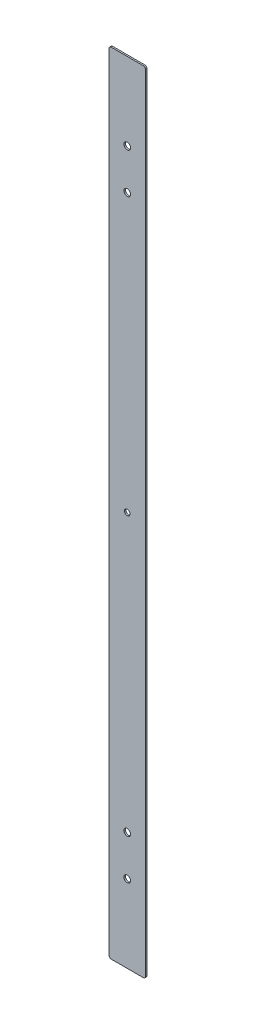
ISO-10303-21;
HEADER;
FILE_DESCRIPTION(('STEP AP214'),'2;1');
FILE_NAME('part.step','',(''),(''),'','','');
FILE_SCHEMA(('AUTOMOTIVE_DESIGN { 1 0 10303 214 1 1 1 1 }'));
ENDSEC;
DATA;
#1=APPLICATION_CONTEXT('core data for automotive mechanical design processes');
#2=APPLICATION_PROTOCOL_DEFINITION('international standard','automotive_design',2000,#1);
#3=PRODUCT_CONTEXT('',#1,'mechanical');
#4=PRODUCT('Part','Part','',(#3));
#5=PRODUCT_RELATED_PRODUCT_CATEGORY('part','',(#4));
#6=PRODUCT_DEFINITION_FORMATION('','',#4);
#7=PRODUCT_DEFINITION_CONTEXT('part definition',#1,'design');
#8=PRODUCT_DEFINITION('design','',#6,#7);
#9=PRODUCT_DEFINITION_SHAPE('','',#8);
#10=(LENGTH_UNIT() NAMED_UNIT(*) SI_UNIT(.MILLI.,.METRE.));
#11=(NAMED_UNIT(*) PLANE_ANGLE_UNIT() SI_UNIT($,.RADIAN.));
#12=(NAMED_UNIT(*) SI_UNIT($,.STERADIAN.) SOLID_ANGLE_UNIT());
#13=UNCERTAINTY_MEASURE_WITH_UNIT(LENGTH_MEASURE(1.E-05),#10,'distance_accuracy_value','');
#14=(GEOMETRIC_REPRESENTATION_CONTEXT(3) GLOBAL_UNCERTAINTY_ASSIGNED_CONTEXT((#13)) GLOBAL_UNIT_ASSIGNED_CONTEXT((#10,
#11,#12)) REPRESENTATION_CONTEXT('',''));
#15=CARTESIAN_POINT('',(0.,0.,0.));
#16=DIRECTION('',(0.,0.,1.));
#17=DIRECTION('',(1.,0.,0.));
#18=AXIS2_PLACEMENT_3D('',#15,#16,#17);
#19=CARTESIAN_POINT('',(18.,-392.,1.5));
#20=DIRECTION('',(-1.,0.,0.));
#21=DIRECTION('',(0.,0.,1.));
#22=AXIS2_PLACEMENT_3D('',#19,#20,#21);
#23=PLANE('',#22);
#24=DIRECTION('',(0.,1.,0.));
#25=VECTOR('',#24,1.);
#26=CARTESIAN_POINT('',(18.,-392.,0.));
#27=LINE('',#26,#25);
#28=CARTESIAN_POINT('',(18.,-390.,0.));
#29=VERTEX_POINT('',#28);
#30=CARTESIAN_POINT('',(18.,390.,0.));
#31=VERTEX_POINT('',#30);
#32=EDGE_CURVE('E127',#29,#31,#27,.T.);
#33=ORIENTED_EDGE('',*,*,#32,.T.);
#34=DIRECTION('',(0.,0.,-1.));
#35=VECTOR('',#34,1.);
#36=CARTESIAN_POINT('',(18.,390.,1.5));
#37=LINE('',#36,#35);
#38=CARTESIAN_POINT('',(18.,390.,1.5));
#39=VERTEX_POINT('',#38);
#40=EDGE_CURVE('E105',#31,#39,#37,.F.);
#41=ORIENTED_EDGE('',*,*,#40,.T.);
#42=DIRECTION('',(0.,1.,0.));
#43=VECTOR('',#42,1.);
#44=CARTESIAN_POINT('',(18.,-392.,1.5));
#45=LINE('',#44,#43);
#46=CARTESIAN_POINT('',(18.,-390.,1.5));
#47=VERTEX_POINT('',#46);
#48=EDGE_CURVE('E137',#47,#39,#45,.T.);
#49=ORIENTED_EDGE('',*,*,#48,.F.);
#50=DIRECTION('',(0.,0.,-1.));
#51=VECTOR('',#50,1.);
#52=CARTESIAN_POINT('',(18.,-390.,1.5));
#53=LINE('',#52,#51);
#54=EDGE_CURVE('E110',#47,#29,#53,.T.);
#55=ORIENTED_EDGE('',*,*,#54,.T.);
#56=EDGE_LOOP('',(#33,#41,#49,#55));
#57=FACE_BOUND('',#56,.T.);
#58=ADVANCED_FACE('F34',(#57),#23,.F.);
#59=CARTESIAN_POINT('',(-18.,392.,1.5));
#60=DIRECTION('',(0.,-1.,0.));
#61=DIRECTION('',(0.,0.,-1.));
#62=AXIS2_PLACEMENT_3D('',#59,#60,#61);
#63=PLANE('',#62);
#64=DIRECTION('',(-1.,0.,0.));
#65=VECTOR('',#64,1.);
#66=CARTESIAN_POINT('',(-18.,392.,1.5));
#67=LINE('',#66,#65);
#68=CARTESIAN_POINT('',(16.,392.,1.5));
#69=VERTEX_POINT('',#68);
#70=CARTESIAN_POINT('',(-16.,392.,1.5));
#71=VERTEX_POINT('',#70);
#72=EDGE_CURVE('E120',#69,#71,#67,.T.);
#73=ORIENTED_EDGE('',*,*,#72,.F.);
#74=DIRECTION('',(0.,0.,-1.));
#75=VECTOR('',#74,1.);
#76=CARTESIAN_POINT('',(16.,392.,1.5));
#77=LINE('',#76,#75);
#78=CARTESIAN_POINT('',(16.,392.,0.));
#79=VERTEX_POINT('',#78);
#80=EDGE_CURVE('E104',#69,#79,#77,.T.);
#81=ORIENTED_EDGE('',*,*,#80,.T.);
#82=DIRECTION('',(-1.,0.,0.));
#83=VECTOR('',#82,1.);
#84=CARTESIAN_POINT('',(-18.,392.,0.));
#85=LINE('',#84,#83);
#86=CARTESIAN_POINT('',(-16.,392.,0.));
#87=VERTEX_POINT('',#86);
#88=EDGE_CURVE('E117',#79,#87,#85,.T.);
#89=ORIENTED_EDGE('',*,*,#88,.T.);
#90=DIRECTION('',(0.,0.,-1.));
#91=VECTOR('',#90,1.);
#92=CARTESIAN_POINT('',(-16.,392.,1.5));
#93=LINE('',#92,#91);
#94=EDGE_CURVE('E122',#87,#71,#93,.F.);
#95=ORIENTED_EDGE('',*,*,#94,.T.);
#96=EDGE_LOOP('',(#73,#81,#89,#95));
#97=FACE_BOUND('',#96,.T.);
#98=ADVANCED_FACE('F116',(#97),#63,.F.);
#99=CARTESIAN_POINT('',(-18.,-392.,1.5));
#100=DIRECTION('',(1.,0.,0.));
#101=DIRECTION('',(0.,0.,-1.));
#102=AXIS2_PLACEMENT_3D('',#99,#100,#101);
#103=PLANE('',#102);
#104=DIRECTION('',(0.,-1.,0.));
#105=VECTOR('',#104,1.);
#106=CARTESIAN_POINT('',(-18.,-392.,1.5));
#107=LINE('',#106,#105);
#108=CARTESIAN_POINT('',(-18.,390.,1.5));
#109=VERTEX_POINT('',#108);
#110=CARTESIAN_POINT('',(-18.,-390.,1.5));
#111=VERTEX_POINT('',#110);
#112=EDGE_CURVE('E163',#109,#111,#107,.T.);
#113=ORIENTED_EDGE('',*,*,#112,.F.);
#114=DIRECTION('',(0.,0.,-1.));
#115=VECTOR('',#114,1.);
#116=CARTESIAN_POINT('',(-18.,390.,1.5));
#117=LINE('',#116,#115);
#118=CARTESIAN_POINT('',(-18.,390.,0.));
#119=VERTEX_POINT('',#118);
#120=EDGE_CURVE('E156',#109,#119,#117,.T.);
#121=ORIENTED_EDGE('',*,*,#120,.T.);
#122=DIRECTION('',(0.,-1.,0.));
#123=VECTOR('',#122,1.);
#124=CARTESIAN_POINT('',(-18.,-392.,0.));
#125=LINE('',#124,#123);
#126=CARTESIAN_POINT('',(-18.,-390.,0.));
#127=VERTEX_POINT('',#126);
#128=EDGE_CURVE('E126',#119,#127,#125,.T.);
#129=ORIENTED_EDGE('',*,*,#128,.T.);
#130=DIRECTION('',(0.,0.,-1.));
#131=VECTOR('',#130,1.);
#132=CARTESIAN_POINT('',(-18.,-390.,1.5));
#133=LINE('',#132,#131);
#134=EDGE_CURVE('E154',#127,#111,#133,.F.);
#135=ORIENTED_EDGE('',*,*,#134,.T.);
#136=EDGE_LOOP('',(#113,#121,#129,#135));
#137=FACE_BOUND('',#136,.T.);
#138=ADVANCED_FACE('F161',(#137),#103,.F.);
#139=CARTESIAN_POINT('',(-18.,-392.,1.5));
#140=DIRECTION('',(0.,1.,0.));
#141=DIRECTION('',(0.,0.,1.));
#142=AXIS2_PLACEMENT_3D('',#139,#140,#141);
#143=PLANE('',#142);
#144=DIRECTION('',(1.,0.,0.));
#145=VECTOR('',#144,1.);
#146=CARTESIAN_POINT('',(-18.,-392.,1.5));
#147=LINE('',#146,#145);
#148=CARTESIAN_POINT('',(-16.,-392.,1.5));
#149=VERTEX_POINT('',#148);
#150=CARTESIAN_POINT('',(16.,-392.,1.5));
#151=VERTEX_POINT('',#150);
#152=EDGE_CURVE('E138',#149,#151,#147,.T.);
#153=ORIENTED_EDGE('',*,*,#152,.F.);
#154=DIRECTION('',(0.,0.,-1.));
#155=VECTOR('',#154,1.);
#156=CARTESIAN_POINT('',(-16.,-392.,1.5));
#157=LINE('',#156,#155);
#158=CARTESIAN_POINT('',(-16.,-392.,0.));
#159=VERTEX_POINT('',#158);
#160=EDGE_CURVE('E11',#149,#159,#157,.T.);
#161=ORIENTED_EDGE('',*,*,#160,.T.);
#162=DIRECTION('',(1.,0.,0.));
#163=VECTOR('',#162,1.);
#164=CARTESIAN_POINT('',(-18.,-392.,0.));
#165=LINE('',#164,#163);
#166=CARTESIAN_POINT('',(16.,-392.,0.));
#167=VERTEX_POINT('',#166);
#168=EDGE_CURVE('E130',#159,#167,#165,.T.);
#169=ORIENTED_EDGE('',*,*,#168,.T.);
#170=DIRECTION('',(0.,0.,-1.));
#171=VECTOR('',#170,1.);
#172=CARTESIAN_POINT('',(16.,-392.,1.5));
#173=LINE('',#172,#171);
#174=EDGE_CURVE('E42',#167,#151,#173,.F.);
#175=ORIENTED_EDGE('',*,*,#174,.T.);
#176=EDGE_LOOP('',(#153,#161,#169,#175));
#177=FACE_BOUND('',#176,.T.);
#178=ADVANCED_FACE('F170',(#177),#143,.F.);
#179=CARTESIAN_POINT('',(0.,0.,1.5));
#180=DIRECTION('',(0.,0.,-1.));
#181=DIRECTION('',(-1.,0.,0.));
#182=AXIS2_PLACEMENT_3D('',#179,#180,#181);
#183=PLANE('',#182);
#184=CARTESIAN_POINT('',(0.,0.,1.5));
#185=DIRECTION('',(0.,0.,1.));
#186=DIRECTION('',(1.,0.,0.));
#187=AXIS2_PLACEMENT_3D('',#184,#185,#186);
#188=CIRCLE('',#187,2.74999999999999);
#189=CARTESIAN_POINT('',(2.74999999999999,0.,1.5));
#190=VERTEX_POINT('',#189);
#191=EDGE_CURVE('E203',#190,#190,#188,.T.);
#192=ORIENTED_EDGE('',*,*,#191,.F.);
#193=EDGE_LOOP('',(#192));
#194=FACE_BOUND('',#193,.T.);
#195=CARTESIAN_POINT('',(0.,315.,1.5));
#196=DIRECTION('',(0.,0.,1.));
#197=DIRECTION('',(1.,0.,0.));
#198=AXIS2_PLACEMENT_3D('',#195,#196,#197);
#199=CIRCLE('',#198,3.29999999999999);
#200=CARTESIAN_POINT('',(3.29999999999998,315.,1.5));
#201=VERTEX_POINT('',#200);
#202=EDGE_CURVE('E197',#201,#201,#199,.T.);
#203=ORIENTED_EDGE('',*,*,#202,.F.);
#204=EDGE_LOOP('',(#203));
#205=FACE_BOUND('',#204,.T.);
#206=CARTESIAN_POINT('',(0.,275.,1.5));
#207=DIRECTION('',(0.,0.,1.));
#208=DIRECTION('',(1.,0.,0.));
#209=AXIS2_PLACEMENT_3D('',#206,#207,#208);
#210=CIRCLE('',#209,3.29999999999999);
#211=CARTESIAN_POINT('',(3.29999999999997,275.,1.5));
#212=VERTEX_POINT('',#211);
#213=EDGE_CURVE('E191',#212,#212,#210,.T.);
#214=ORIENTED_EDGE('',*,*,#213,.F.);
#215=EDGE_LOOP('',(#214));
#216=FACE_BOUND('',#215,.T.);
#217=CARTESIAN_POINT('',(0.,-275.,1.5));
#218=DIRECTION('',(0.,0.,1.));
#219=DIRECTION('',(1.,0.,0.));
#220=AXIS2_PLACEMENT_3D('',#217,#218,#219);
#221=CIRCLE('',#220,3.29999999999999);
#222=CARTESIAN_POINT('',(3.29999999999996,-275.,1.5));
#223=VERTEX_POINT('',#222);
#224=EDGE_CURVE('E185',#223,#223,#221,.T.);
#225=ORIENTED_EDGE('',*,*,#224,.F.);
#226=EDGE_LOOP('',(#225));
#227=FACE_BOUND('',#226,.T.);
#228=CARTESIAN_POINT('',(0.,-315.,1.5));
#229=DIRECTION('',(0.,0.,1.));
#230=DIRECTION('',(1.,0.,0.));
#231=AXIS2_PLACEMENT_3D('',#228,#229,#230);
#232=CIRCLE('',#231,3.29999999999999);
#233=CARTESIAN_POINT('',(3.3,-315.,1.5));
#234=VERTEX_POINT('',#233);
#235=EDGE_CURVE('E179',#234,#234,#232,.T.);
#236=ORIENTED_EDGE('',*,*,#235,.F.);
#237=EDGE_LOOP('',(#236));
#238=FACE_BOUND('',#237,.T.);
#239=ORIENTED_EDGE('',*,*,#48,.T.);
#240=CARTESIAN_POINT('',(16.,390.,1.5));
#241=DIRECTION('',(0.,0.,-1.));
#242=DIRECTION('',(-1.,0.,0.));
#243=AXIS2_PLACEMENT_3D('',#240,#241,#242);
#244=CIRCLE('',#243,2.);
#245=EDGE_CURVE('E152',#39,#69,#244,.F.);
#246=ORIENTED_EDGE('',*,*,#245,.T.);
#247=ORIENTED_EDGE('',*,*,#72,.T.);
#248=CARTESIAN_POINT('',(-16.,390.,1.5));
#249=DIRECTION('',(0.,0.,-1.));
#250=DIRECTION('',(-1.,0.,0.));
#251=AXIS2_PLACEMENT_3D('',#248,#249,#250);
#252=CIRCLE('',#251,2.);
#253=EDGE_CURVE('E150',#71,#109,#252,.F.);
#254=ORIENTED_EDGE('',*,*,#253,.T.);
#255=ORIENTED_EDGE('',*,*,#112,.T.);
#256=CARTESIAN_POINT('',(-16.,-390.,1.5));
#257=DIRECTION('',(0.,0.,-1.));
#258=DIRECTION('',(-1.,0.,0.));
#259=AXIS2_PLACEMENT_3D('',#256,#257,#258);
#260=CIRCLE('',#259,2.);
#261=EDGE_CURVE('E55',#111,#149,#260,.F.);
#262=ORIENTED_EDGE('',*,*,#261,.T.);
#263=ORIENTED_EDGE('',*,*,#152,.T.);
#264=CARTESIAN_POINT('',(16.,-390.,1.5));
#265=DIRECTION('',(0.,0.,-1.));
#266=DIRECTION('',(-1.,0.,0.));
#267=AXIS2_PLACEMENT_3D('',#264,#265,#266);
#268=CIRCLE('',#267,2.);
#269=EDGE_CURVE('E147',#151,#47,#268,.F.);
#270=ORIENTED_EDGE('',*,*,#269,.T.);
#271=EDGE_LOOP('',(#239,#246,#247,#254,#255,#262,#263,#270));
#272=FACE_BOUND('',#271,.T.);
#273=ADVANCED_FACE('F209',(#194,#205,#216,#227,#238,#272),#183,.F.);
#274=CARTESIAN_POINT('',(0.,0.,0.));
#275=DIRECTION('',(0.,0.,-1.));
#276=DIRECTION('',(-1.,0.,0.));
#277=AXIS2_PLACEMENT_3D('',#274,#275,#276);
#278=PLANE('',#277);
#279=CARTESIAN_POINT('',(0.,0.,0.));
#280=DIRECTION('',(0.,0.,1.));
#281=DIRECTION('',(1.,0.,0.));
#282=AXIS2_PLACEMENT_3D('',#279,#280,#281);
#283=CIRCLE('',#282,2.75);
#284=CARTESIAN_POINT('',(2.75,0.,0.));
#285=VERTEX_POINT('',#284);
#286=EDGE_CURVE('E200',#285,#285,#283,.T.);
#287=ORIENTED_EDGE('',*,*,#286,.T.);
#288=EDGE_LOOP('',(#287));
#289=FACE_BOUND('',#288,.T.);
#290=CARTESIAN_POINT('',(0.,315.,0.));
#291=DIRECTION('',(0.,0.,1.));
#292=DIRECTION('',(1.,0.,0.));
#293=AXIS2_PLACEMENT_3D('',#290,#291,#292);
#294=CIRCLE('',#293,3.29999999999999);
#295=CARTESIAN_POINT('',(3.29999999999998,315.,0.));
#296=VERTEX_POINT('',#295);
#297=EDGE_CURVE('E194',#296,#296,#294,.T.);
#298=ORIENTED_EDGE('',*,*,#297,.T.);
#299=EDGE_LOOP('',(#298));
#300=FACE_BOUND('',#299,.T.);
#301=CARTESIAN_POINT('',(0.,275.,0.));
#302=DIRECTION('',(0.,0.,1.));
#303=DIRECTION('',(1.,0.,0.));
#304=AXIS2_PLACEMENT_3D('',#301,#302,#303);
#305=CIRCLE('',#304,3.29999999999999);
#306=CARTESIAN_POINT('',(3.29999999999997,275.,0.));
#307=VERTEX_POINT('',#306);
#308=EDGE_CURVE('E188',#307,#307,#305,.T.);
#309=ORIENTED_EDGE('',*,*,#308,.T.);
#310=EDGE_LOOP('',(#309));
#311=FACE_BOUND('',#310,.T.);
#312=CARTESIAN_POINT('',(0.,-275.,0.));
#313=DIRECTION('',(0.,0.,1.));
#314=DIRECTION('',(1.,0.,0.));
#315=AXIS2_PLACEMENT_3D('',#312,#313,#314);
#316=CIRCLE('',#315,3.29999999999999);
#317=CARTESIAN_POINT('',(3.29999999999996,-275.,0.));
#318=VERTEX_POINT('',#317);
#319=EDGE_CURVE('E182',#318,#318,#316,.T.);
#320=ORIENTED_EDGE('',*,*,#319,.T.);
#321=EDGE_LOOP('',(#320));
#322=FACE_BOUND('',#321,.T.);
#323=CARTESIAN_POINT('',(0.,-315.,0.));
#324=DIRECTION('',(0.,0.,1.));
#325=DIRECTION('',(1.,0.,0.));
#326=AXIS2_PLACEMENT_3D('',#323,#324,#325);
#327=CIRCLE('',#326,3.29999999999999);
#328=CARTESIAN_POINT('',(3.3,-315.,0.));
#329=VERTEX_POINT('',#328);
#330=EDGE_CURVE('E132',#329,#329,#327,.T.);
#331=ORIENTED_EDGE('',*,*,#330,.T.);
#332=EDGE_LOOP('',(#331));
#333=FACE_BOUND('',#332,.T.);
#334=ORIENTED_EDGE('',*,*,#88,.F.);
#335=CARTESIAN_POINT('',(16.,390.,0.));
#336=DIRECTION('',(0.,0.,-1.));
#337=DIRECTION('',(-1.,0.,0.));
#338=AXIS2_PLACEMENT_3D('',#335,#336,#337);
#339=CIRCLE('',#338,2.);
#340=EDGE_CURVE('E100',#79,#31,#339,.T.);
#341=ORIENTED_EDGE('',*,*,#340,.T.);
#342=ORIENTED_EDGE('',*,*,#32,.F.);
#343=CARTESIAN_POINT('',(16.,-390.,0.));
#344=DIRECTION('',(0.,0.,-1.));
#345=DIRECTION('',(-1.,0.,0.));
#346=AXIS2_PLACEMENT_3D('',#343,#344,#345);
#347=CIRCLE('',#346,2.);
#348=EDGE_CURVE('E121',#29,#167,#347,.T.);
#349=ORIENTED_EDGE('',*,*,#348,.T.);
#350=ORIENTED_EDGE('',*,*,#168,.F.);
#351=CARTESIAN_POINT('',(-16.,-390.,0.));
#352=DIRECTION('',(0.,0.,-1.));
#353=DIRECTION('',(-1.,0.,0.));
#354=AXIS2_PLACEMENT_3D('',#351,#352,#353);
#355=CIRCLE('',#354,2.);
#356=EDGE_CURVE('E141',#159,#127,#355,.T.);
#357=ORIENTED_EDGE('',*,*,#356,.T.);
#358=ORIENTED_EDGE('',*,*,#128,.F.);
#359=CARTESIAN_POINT('',(-16.,390.,0.));
#360=DIRECTION('',(0.,0.,-1.));
#361=DIRECTION('',(-1.,0.,0.));
#362=AXIS2_PLACEMENT_3D('',#359,#360,#361);
#363=CIRCLE('',#362,2.);
#364=EDGE_CURVE('E111',#119,#87,#363,.T.);
#365=ORIENTED_EDGE('',*,*,#364,.T.);
#366=EDGE_LOOP('',(#334,#341,#342,#349,#350,#357,#358,#365));
#367=FACE_BOUND('',#366,.T.);
#368=ADVANCED_FACE('F124',(#289,#300,#311,#322,#333,#367),#278,.T.);
#369=CARTESIAN_POINT('',(0.,-315.,1.5));
#370=DIRECTION('',(0.,0.,1.));
#371=DIRECTION('',(1.,0.,0.));
#372=AXIS2_PLACEMENT_3D('',#369,#370,#371);
#373=CYLINDRICAL_SURFACE('',#372,3.29999999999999);
#374=ORIENTED_EDGE('',*,*,#330,.F.);
#375=EDGE_LOOP('',(#374));
#376=FACE_BOUND('',#375,.T.);
#377=ORIENTED_EDGE('',*,*,#235,.T.);
#378=EDGE_LOOP('',(#377));
#379=FACE_BOUND('',#378,.T.);
#380=ADVANCED_FACE('F275',(#376,#379),#373,.F.);
#381=CARTESIAN_POINT('',(0.,-275.,1.5));
#382=DIRECTION('',(0.,0.,1.));
#383=DIRECTION('',(1.,0.,0.));
#384=AXIS2_PLACEMENT_3D('',#381,#382,#383);
#385=CYLINDRICAL_SURFACE('',#384,3.29999999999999);
#386=ORIENTED_EDGE('',*,*,#319,.F.);
#387=EDGE_LOOP('',(#386));
#388=FACE_BOUND('',#387,.T.);
#389=ORIENTED_EDGE('',*,*,#224,.T.);
#390=EDGE_LOOP('',(#389));
#391=FACE_BOUND('',#390,.T.);
#392=ADVANCED_FACE('F290',(#388,#391),#385,.F.);
#393=CARTESIAN_POINT('',(0.,275.,1.5));
#394=DIRECTION('',(0.,0.,1.));
#395=DIRECTION('',(1.,0.,0.));
#396=AXIS2_PLACEMENT_3D('',#393,#394,#395);
#397=CYLINDRICAL_SURFACE('',#396,3.29999999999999);
#398=ORIENTED_EDGE('',*,*,#308,.F.);
#399=EDGE_LOOP('',(#398));
#400=FACE_BOUND('',#399,.T.);
#401=ORIENTED_EDGE('',*,*,#213,.T.);
#402=EDGE_LOOP('',(#401));
#403=FACE_BOUND('',#402,.T.);
#404=ADVANCED_FACE('F297',(#400,#403),#397,.F.);
#405=CARTESIAN_POINT('',(0.,315.,1.5));
#406=DIRECTION('',(0.,0.,1.));
#407=DIRECTION('',(1.,0.,0.));
#408=AXIS2_PLACEMENT_3D('',#405,#406,#407);
#409=CYLINDRICAL_SURFACE('',#408,3.29999999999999);
#410=ORIENTED_EDGE('',*,*,#297,.F.);
#411=EDGE_LOOP('',(#410));
#412=FACE_BOUND('',#411,.T.);
#413=ORIENTED_EDGE('',*,*,#202,.T.);
#414=EDGE_LOOP('',(#413));
#415=FACE_BOUND('',#414,.T.);
#416=ADVANCED_FACE('F242',(#412,#415),#409,.F.);
#417=CARTESIAN_POINT('',(16.,390.,1.5));
#418=DIRECTION('',(0.,0.,-1.));
#419=DIRECTION('',(-1.,0.,0.));
#420=AXIS2_PLACEMENT_3D('',#417,#418,#419);
#421=CYLINDRICAL_SURFACE('',#420,2.);
#422=ORIENTED_EDGE('',*,*,#245,.F.);
#423=ORIENTED_EDGE('',*,*,#40,.F.);
#424=ORIENTED_EDGE('',*,*,#340,.F.);
#425=ORIENTED_EDGE('',*,*,#80,.F.);
#426=EDGE_LOOP('',(#422,#423,#424,#425));
#427=FACE_BOUND('',#426,.T.);
#428=ADVANCED_FACE('F103',(#427),#421,.T.);
#429=CARTESIAN_POINT('',(-16.,390.,1.5));
#430=DIRECTION('',(0.,0.,-1.));
#431=DIRECTION('',(-1.,0.,0.));
#432=AXIS2_PLACEMENT_3D('',#429,#430,#431);
#433=CYLINDRICAL_SURFACE('',#432,2.);
#434=ORIENTED_EDGE('',*,*,#253,.F.);
#435=ORIENTED_EDGE('',*,*,#94,.F.);
#436=ORIENTED_EDGE('',*,*,#364,.F.);
#437=ORIENTED_EDGE('',*,*,#120,.F.);
#438=EDGE_LOOP('',(#434,#435,#436,#437));
#439=FACE_BOUND('',#438,.T.);
#440=ADVANCED_FACE('F231',(#439),#433,.T.);
#441=CARTESIAN_POINT('',(-16.,-390.,1.5));
#442=DIRECTION('',(0.,0.,-1.));
#443=DIRECTION('',(-1.,0.,0.));
#444=AXIS2_PLACEMENT_3D('',#441,#442,#443);
#445=CYLINDRICAL_SURFACE('',#444,2.);
#446=ORIENTED_EDGE('',*,*,#261,.F.);
#447=ORIENTED_EDGE('',*,*,#134,.F.);
#448=ORIENTED_EDGE('',*,*,#356,.F.);
#449=ORIENTED_EDGE('',*,*,#160,.F.);
#450=EDGE_LOOP('',(#446,#447,#448,#449));
#451=FACE_BOUND('',#450,.T.);
#452=ADVANCED_FACE('F169',(#451),#445,.T.);
#453=CARTESIAN_POINT('',(16.,-390.,1.5));
#454=DIRECTION('',(0.,0.,-1.));
#455=DIRECTION('',(-1.,0.,0.));
#456=AXIS2_PLACEMENT_3D('',#453,#454,#455);
#457=CYLINDRICAL_SURFACE('',#456,2.);
#458=ORIENTED_EDGE('',*,*,#269,.F.);
#459=ORIENTED_EDGE('',*,*,#174,.F.);
#460=ORIENTED_EDGE('',*,*,#348,.F.);
#461=ORIENTED_EDGE('',*,*,#54,.F.);
#462=EDGE_LOOP('',(#458,#459,#460,#461));
#463=FACE_BOUND('',#462,.T.);
#464=ADVANCED_FACE('F36',(#463),#457,.T.);
#465=CARTESIAN_POINT('',(0.,0.,1.5));
#466=DIRECTION('',(0.,0.,1.));
#467=DIRECTION('',(1.,0.,0.));
#468=AXIS2_PLACEMENT_3D('',#465,#466,#467);
#469=CYLINDRICAL_SURFACE('',#468,2.74999999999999);
#470=ORIENTED_EDGE('',*,*,#286,.F.);
#471=EDGE_LOOP('',(#470));
#472=FACE_BOUND('',#471,.T.);
#473=ORIENTED_EDGE('',*,*,#191,.T.);
#474=EDGE_LOOP('',(#473));
#475=FACE_BOUND('',#474,.T.);
#476=ADVANCED_FACE('F207',(#472,#475),#469,.F.);
#477=CLOSED_SHELL('',(#58,#98,#138,#178,#273,#368,#380,#392,#404,#416,#428,#440,#452,#464,#476));
#478=MANIFOLD_SOLID_BREP('B2',#477);
#479=ADVANCED_BREP_SHAPE_REPRESENTATION('',(#18,#478),#14);
#480=SHAPE_DEFINITION_REPRESENTATION(#9,#479);
ENDSEC;
END-ISO-10303-21;
